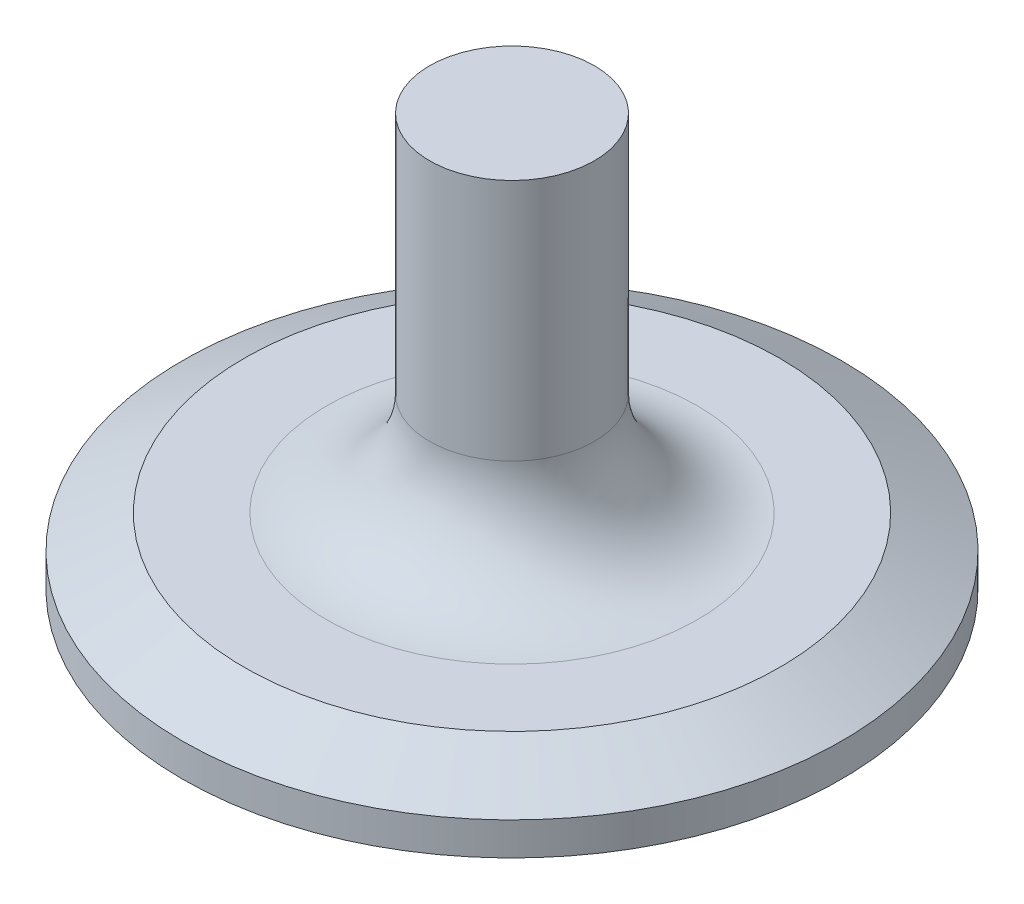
ISO-10303-21;
HEADER;
FILE_DESCRIPTION(('STEP AP214'),'2;1');
FILE_NAME('part.step','',(''),(''),'','','');
FILE_SCHEMA(('AUTOMOTIVE_DESIGN { 1 0 10303 214 1 1 1 1 }'));
ENDSEC;
DATA;
#1=APPLICATION_CONTEXT('core data for automotive mechanical design processes');
#2=APPLICATION_PROTOCOL_DEFINITION('international standard','automotive_design',2000,#1);
#3=PRODUCT_CONTEXT('',#1,'mechanical');
#4=PRODUCT('Part','Part','',(#3));
#5=PRODUCT_RELATED_PRODUCT_CATEGORY('part','',(#4));
#6=PRODUCT_DEFINITION_FORMATION('','',#4);
#7=PRODUCT_DEFINITION_CONTEXT('part definition',#1,'design');
#8=PRODUCT_DEFINITION('design','',#6,#7);
#9=PRODUCT_DEFINITION_SHAPE('','',#8);
#10=(LENGTH_UNIT() NAMED_UNIT(*) SI_UNIT(.MILLI.,.METRE.));
#11=(NAMED_UNIT(*) PLANE_ANGLE_UNIT() SI_UNIT($,.RADIAN.));
#12=(NAMED_UNIT(*) SI_UNIT($,.STERADIAN.) SOLID_ANGLE_UNIT());
#13=UNCERTAINTY_MEASURE_WITH_UNIT(LENGTH_MEASURE(1.E-05),#10,'distance_accuracy_value','');
#14=(GEOMETRIC_REPRESENTATION_CONTEXT(3) GLOBAL_UNCERTAINTY_ASSIGNED_CONTEXT((#13)) GLOBAL_UNIT_ASSIGNED_CONTEXT((#10,
#11,#12)) REPRESENTATION_CONTEXT('',''));
#15=CARTESIAN_POINT('',(0.,0.,0.));
#16=DIRECTION('',(0.,0.,1.));
#17=DIRECTION('',(1.,0.,0.));
#18=AXIS2_PLACEMENT_3D('',#15,#16,#17);
#19=CARTESIAN_POINT('',(-20.,100.,0.));
#20=DIRECTION('',(0.,-1.,0.));
#21=DIRECTION('',(0.,0.,-1.));
#22=AXIS2_PLACEMENT_3D('',#19,#20,#21);
#23=PLANE('',#22);
#24=CARTESIAN_POINT('',(0.,100.,0.));
#25=DIRECTION('',(0.,-1.,0.));
#26=DIRECTION('',(0.,0.,-1.));
#27=AXIS2_PLACEMENT_3D('',#24,#25,#26);
#28=CIRCLE('',#27,20.);
#29=CARTESIAN_POINT('',(0.,100.,-20.));
#30=VERTEX_POINT('',#29);
#31=EDGE_CURVE('E10',#30,#30,#28,.T.);
#32=ORIENTED_EDGE('',*,*,#31,.F.);
#33=EDGE_LOOP('',(#32));
#34=FACE_BOUND('',#33,.T.);
#35=ADVANCED_FACE('F28',(#34),#23,.F.);
#36=CARTESIAN_POINT('',(0.,-70.2514367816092,0.));
#37=DIRECTION('',(0.,-1.,0.));
#38=DIRECTION('',(0.,0.,-1.));
#39=AXIS2_PLACEMENT_3D('',#36,#37,#38);
#40=CYLINDRICAL_SURFACE('',#39,20.);
#41=CARTESIAN_POINT('',(0.,41.,0.));
#42=DIRECTION('',(0.,-1.,0.));
#43=DIRECTION('',(0.,0.,-1.));
#44=AXIS2_PLACEMENT_3D('',#41,#42,#43);
#45=CIRCLE('',#44,20.);
#46=CARTESIAN_POINT('',(0.,41.,-20.));
#47=VERTEX_POINT('',#46);
#48=EDGE_CURVE('E34',#47,#47,#45,.T.);
#49=ORIENTED_EDGE('',*,*,#48,.F.);
#50=EDGE_LOOP('',(#49));
#51=FACE_BOUND('',#50,.T.);
#52=ORIENTED_EDGE('',*,*,#31,.T.);
#53=EDGE_LOOP('',(#52));
#54=FACE_BOUND('',#53,.T.);
#55=ADVANCED_FACE('F76',(#51,#54),#40,.T.);
#56=CARTESIAN_POINT('',(0.,41.,0.));
#57=DIRECTION('',(0.,-1.,0.));
#58=DIRECTION('',(0.,0.,-1.));
#59=AXIS2_PLACEMENT_3D('',#56,#57,#58);
#60=TOROIDAL_SURFACE('',#59,45.,25.);
#61=CARTESIAN_POINT('',(0.,16.,0.));
#62=DIRECTION('',(0.,-1.,0.));
#63=DIRECTION('',(0.,0.,-1.));
#64=AXIS2_PLACEMENT_3D('',#61,#62,#63);
#65=CIRCLE('',#64,45.);
#66=CARTESIAN_POINT('',(0.,16.,-45.));
#67=VERTEX_POINT('',#66);
#68=EDGE_CURVE('E38',#67,#67,#65,.T.);
#69=ORIENTED_EDGE('',*,*,#68,.F.);
#70=EDGE_LOOP('',(#69));
#71=FACE_BOUND('',#70,.T.);
#72=ORIENTED_EDGE('',*,*,#48,.T.);
#73=EDGE_LOOP('',(#72));
#74=FACE_BOUND('',#73,.T.);
#75=ADVANCED_FACE('F71',(#71,#74),#60,.F.);
#76=CARTESIAN_POINT('',(-65.,16.,0.));
#77=DIRECTION('',(0.,-1.,0.));
#78=DIRECTION('',(0.,0.,-1.));
#79=AXIS2_PLACEMENT_3D('',#76,#77,#78);
#80=PLANE('',#79);
#81=CARTESIAN_POINT('',(0.,16.,0.));
#82=DIRECTION('',(0.,-1.,0.));
#83=DIRECTION('',(0.,0.,-1.));
#84=AXIS2_PLACEMENT_3D('',#81,#82,#83);
#85=CIRCLE('',#84,65.);
#86=CARTESIAN_POINT('',(0.,16.,-65.));
#87=VERTEX_POINT('',#86);
#88=EDGE_CURVE('E42',#87,#87,#85,.T.);
#89=ORIENTED_EDGE('',*,*,#88,.F.);
#90=EDGE_LOOP('',(#89));
#91=FACE_BOUND('',#90,.T.);
#92=ORIENTED_EDGE('',*,*,#68,.T.);
#93=EDGE_LOOP('',(#92));
#94=FACE_BOUND('',#93,.T.);
#95=ADVANCED_FACE('F65',(#91,#94),#80,.F.);
#96=CARTESIAN_POINT('',(0.,16.,0.));
#97=DIRECTION('',(0.,-1.,0.));
#98=DIRECTION('',(0.,0.,-1.));
#99=AXIS2_PLACEMENT_3D('',#96,#97,#98);
#100=CONICAL_SURFACE('',#99,65.,1.08083900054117);
#101=CARTESIAN_POINT('',(0.,7.99999999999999,0.));
#102=DIRECTION('',(0.,-1.,0.));
#103=DIRECTION('',(0.,0.,-1.));
#104=AXIS2_PLACEMENT_3D('',#101,#102,#103);
#105=CIRCLE('',#104,80.);
#106=CARTESIAN_POINT('',(0.,7.99999999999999,-80.));
#107=VERTEX_POINT('',#106);
#108=EDGE_CURVE('E47',#107,#107,#105,.T.);
#109=ORIENTED_EDGE('',*,*,#108,.F.);
#110=EDGE_LOOP('',(#109));
#111=FACE_BOUND('',#110,.T.);
#112=ORIENTED_EDGE('',*,*,#88,.T.);
#113=EDGE_LOOP('',(#112));
#114=FACE_BOUND('',#113,.T.);
#115=ADVANCED_FACE('F59',(#111,#114),#100,.T.);
#116=CARTESIAN_POINT('',(0.,-70.2514367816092,0.));
#117=DIRECTION('',(0.,-1.,0.));
#118=DIRECTION('',(0.,0.,-1.));
#119=AXIS2_PLACEMENT_3D('',#116,#117,#118);
#120=CYLINDRICAL_SURFACE('',#119,80.);
#121=CARTESIAN_POINT('',(0.,0.,0.));
#122=DIRECTION('',(0.,-1.,0.));
#123=DIRECTION('',(0.,0.,-1.));
#124=AXIS2_PLACEMENT_3D('',#121,#122,#123);
#125=CIRCLE('',#124,80.);
#126=CARTESIAN_POINT('',(0.,0.,-80.));
#127=VERTEX_POINT('',#126);
#128=EDGE_CURVE('E50',#127,#127,#125,.T.);
#129=ORIENTED_EDGE('',*,*,#128,.F.);
#130=EDGE_LOOP('',(#129));
#131=FACE_BOUND('',#130,.T.);
#132=ORIENTED_EDGE('',*,*,#108,.T.);
#133=EDGE_LOOP('',(#132));
#134=FACE_BOUND('',#133,.T.);
#135=ADVANCED_FACE('F56',(#131,#134),#120,.T.);
#136=CARTESIAN_POINT('',(0.,0.,0.));
#137=DIRECTION('',(0.,1.,0.));
#138=DIRECTION('',(0.,0.,1.));
#139=AXIS2_PLACEMENT_3D('',#136,#137,#138);
#140=PLANE('',#139);
#141=ORIENTED_EDGE('',*,*,#128,.T.);
#142=EDGE_LOOP('',(#141));
#143=FACE_BOUND('',#142,.T.);
#144=ADVANCED_FACE('F54',(#143),#140,.F.);
#145=CLOSED_SHELL('',(#35,#55,#75,#95,#115,#135,#144));
#146=MANIFOLD_SOLID_BREP('B2',#145);
#147=ADVANCED_BREP_SHAPE_REPRESENTATION('',(#18,#146),#14);
#148=SHAPE_DEFINITION_REPRESENTATION(#9,#147);
ENDSEC;
END-ISO-10303-21;
